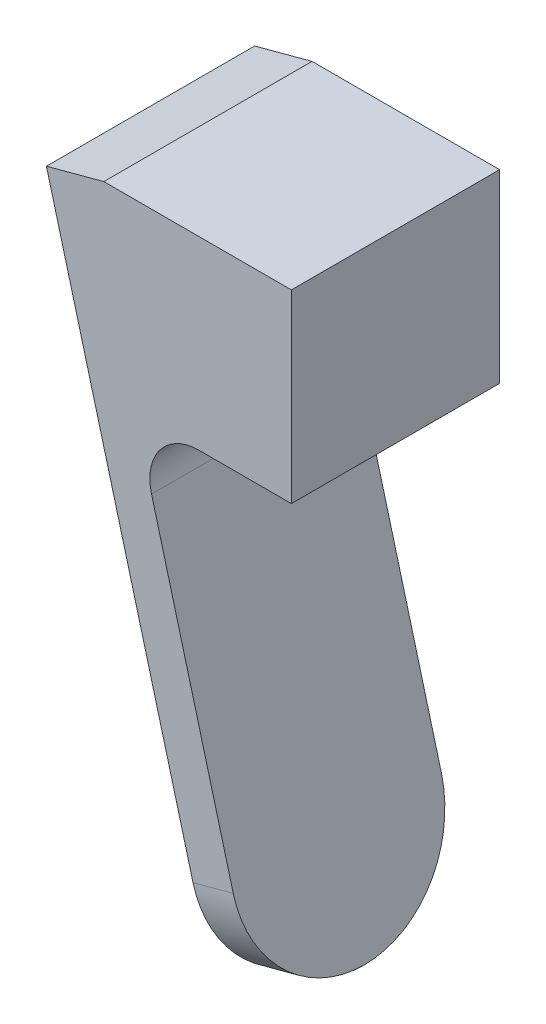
ISO-10303-21;
HEADER;
FILE_DESCRIPTION(('STEP AP214'),'2;1');
FILE_NAME('part.step','',(''),(''),'','','');
FILE_SCHEMA(('AUTOMOTIVE_DESIGN { 1 0 10303 214 1 1 1 1 }'));
ENDSEC;
DATA;
#1=APPLICATION_CONTEXT('core data for automotive mechanical design processes');
#2=APPLICATION_PROTOCOL_DEFINITION('international standard','automotive_design',2000,#1);
#3=PRODUCT_CONTEXT('',#1,'mechanical');
#4=PRODUCT('Part','Part','',(#3));
#5=PRODUCT_RELATED_PRODUCT_CATEGORY('part','',(#4));
#6=PRODUCT_DEFINITION_FORMATION('','',#4);
#7=PRODUCT_DEFINITION_CONTEXT('part definition',#1,'design');
#8=PRODUCT_DEFINITION('design','',#6,#7);
#9=PRODUCT_DEFINITION_SHAPE('','',#8);
#10=(LENGTH_UNIT() NAMED_UNIT(*) SI_UNIT(.MILLI.,.METRE.));
#11=(NAMED_UNIT(*) PLANE_ANGLE_UNIT() SI_UNIT($,.RADIAN.));
#12=(NAMED_UNIT(*) SI_UNIT($,.STERADIAN.) SOLID_ANGLE_UNIT());
#13=UNCERTAINTY_MEASURE_WITH_UNIT(LENGTH_MEASURE(1.E-05),#10,'distance_accuracy_value','');
#14=(GEOMETRIC_REPRESENTATION_CONTEXT(3) GLOBAL_UNCERTAINTY_ASSIGNED_CONTEXT((#13)) GLOBAL_UNIT_ASSIGNED_CONTEXT((#10,
#11,#12)) REPRESENTATION_CONTEXT('',''));
#15=CARTESIAN_POINT('',(0.,0.,0.));
#16=DIRECTION('',(0.,0.,1.));
#17=DIRECTION('',(1.,0.,0.));
#18=AXIS2_PLACEMENT_3D('',#15,#16,#17);
#19=CARTESIAN_POINT('',(-8.22542405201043,-3.67171888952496,5.3975));
#20=DIRECTION('',(0.258819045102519,-0.965925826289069,0.));
#21=DIRECTION('',(0.965925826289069,0.258819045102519,0.));
#22=AXIS2_PLACEMENT_3D('',#19,#20,#21);
#23=PLANE('',#22);
#24=DIRECTION('',(-0.965925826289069,-0.258819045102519,0.));
#25=VECTOR('',#24,1.);
#26=CARTESIAN_POINT('',(-8.22542405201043,-3.67171888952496,-5.3975));
#27=LINE('',#26,#25);
#28=CARTESIAN_POINT('',(-5.24987969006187,-2.87442418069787,-5.3975));
#29=VERTEX_POINT('',#28);
#30=CARTESIAN_POINT('',(-8.22542405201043,-3.67171888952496,-5.3975));
#31=VERTEX_POINT('',#30);
#32=EDGE_CURVE('E140',#29,#31,#27,.T.);
#33=ORIENTED_EDGE('',*,*,#32,.T.);
#34=DIRECTION('',(0.,0.,-1.));
#35=VECTOR('',#34,1.);
#36=CARTESIAN_POINT('',(-8.22542405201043,-3.67171888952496,5.3975));
#37=LINE('',#36,#35);
#38=CARTESIAN_POINT('',(-8.22542405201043,-3.67171888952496,5.3975));
#39=VERTEX_POINT('',#38);
#40=EDGE_CURVE('E165',#39,#31,#37,.T.);
#41=ORIENTED_EDGE('',*,*,#40,.F.);
#42=DIRECTION('',(-0.965925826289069,-0.258819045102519,0.));
#43=VECTOR('',#42,1.);
#44=CARTESIAN_POINT('',(-8.22542405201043,-3.67171888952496,5.3975));
#45=LINE('',#44,#43);
#46=CARTESIAN_POINT('',(-5.24987969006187,-2.87442418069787,5.3975));
#47=VERTEX_POINT('',#46);
#48=EDGE_CURVE('E132',#47,#39,#45,.T.);
#49=ORIENTED_EDGE('',*,*,#48,.F.);
#50=DIRECTION('',(0.,0.,-1.));
#51=VECTOR('',#50,1.);
#52=CARTESIAN_POINT('',(-5.24987969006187,-2.87442418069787,5.3975));
#53=LINE('',#52,#51);
#54=EDGE_CURVE('E139',#47,#29,#53,.T.);
#55=ORIENTED_EDGE('',*,*,#54,.T.);
#56=EDGE_LOOP('',(#33,#41,#49,#55));
#57=FACE_BOUND('',#56,.T.);
#58=ADVANCED_FACE('F33',(#57),#23,.F.);
#59=CARTESIAN_POINT('',(-8.22542405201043,-3.67171888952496,5.3975));
#60=DIRECTION('',(0.965925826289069,0.258819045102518,0.));
#61=DIRECTION('',(-0.258819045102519,0.965925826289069,0.));
#62=AXIS2_PLACEMENT_3D('',#59,#60,#61);
#63=PLANE('',#62);
#64=DIRECTION('',(0.258819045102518,-0.965925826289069,0.));
#65=VECTOR('',#64,1.);
#66=CARTESIAN_POINT('',(-8.22542405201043,-3.67171888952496,-5.3975));
#67=LINE('',#66,#65);
#68=CARTESIAN_POINT('',(-0.624990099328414,-32.0369245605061,-5.3975));
#69=VERTEX_POINT('',#68);
#70=EDGE_CURVE('E143',#31,#69,#67,.T.);
#71=ORIENTED_EDGE('',*,*,#70,.T.);
#72=CARTESIAN_POINT('',(-0.624990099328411,-32.0369245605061,0.));
#73=DIRECTION('',(0.965925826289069,0.258819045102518,0.));
#74=DIRECTION('',(-0.258819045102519,0.965925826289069,0.));
#75=AXIS2_PLACEMENT_3D('',#72,#73,#74);
#76=CIRCLE('',#75,5.3975);
#77=CARTESIAN_POINT('',(0.622258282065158,-36.6917188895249,-2.43110416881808));
#78=VERTEX_POINT('',#77);
#79=EDGE_CURVE('E48',#69,#78,#76,.F.);
#80=ORIENTED_EDGE('',*,*,#79,.T.);
#81=DIRECTION('',(0.,0.,-1.));
#82=VECTOR('',#81,1.);
#83=CARTESIAN_POINT('',(0.622258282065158,-36.6917188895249,5.3975));
#84=LINE('',#83,#82);
#85=CARTESIAN_POINT('',(0.622258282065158,-36.6917188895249,2.43110416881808));
#86=VERTEX_POINT('',#85);
#87=EDGE_CURVE('E162',#86,#78,#84,.T.);
#88=ORIENTED_EDGE('',*,*,#87,.F.);
#89=CARTESIAN_POINT('',(-0.624990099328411,-32.0369245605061,5.3975));
#90=VERTEX_POINT('',#89);
#91=EDGE_CURVE('E199',#86,#90,#76,.F.);
#92=ORIENTED_EDGE('',*,*,#91,.T.);
#93=DIRECTION('',(0.258819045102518,-0.965925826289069,0.));
#94=VECTOR('',#93,1.);
#95=CARTESIAN_POINT('',(-8.22542405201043,-3.67171888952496,5.3975));
#96=LINE('',#95,#94);
#97=EDGE_CURVE('E121',#39,#90,#96,.T.);
#98=ORIENTED_EDGE('',*,*,#97,.F.);
#99=ORIENTED_EDGE('',*,*,#40,.T.);
#100=EDGE_LOOP('',(#71,#80,#88,#92,#98,#99));
#101=FACE_BOUND('',#100,.T.);
#102=ADVANCED_FACE('F203',(#101),#63,.F.);
#103=CARTESIAN_POINT('',(0.622258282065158,-36.6917188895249,5.3975));
#104=DIRECTION('',(0.,1.,0.));
#105=DIRECTION('',(-1.,0.,0.));
#106=AXIS2_PLACEMENT_3D('',#103,#104,#105);
#107=PLANE('',#106);
#108=CARTESIAN_POINT('',(-17.9969190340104,-36.6917188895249,0.));
#109=DIRECTION('',(0.,1.,0.));
#110=DIRECTION('',(1.,0.,0.));
#111=AXIS2_PLACEMENT_3D('',#108,#109,#110);
#112=ELLIPSE('',#111,20.854338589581,5.3975);
#113=CARTESIAN_POINT('',(2.85741955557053,-36.691718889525,0.));
#114=VERTEX_POINT('',#113);
#115=EDGE_CURVE('E122',#78,#114,#112,.F.);
#116=ORIENTED_EDGE('',*,*,#115,.T.);
#117=EDGE_CURVE('E111',#114,#86,#112,.F.);
#118=ORIENTED_EDGE('',*,*,#117,.T.);
#119=ORIENTED_EDGE('',*,*,#87,.T.);
#120=EDGE_LOOP('',(#116,#118,#119));
#121=FACE_BOUND('',#120,.T.);
#122=ADVANCED_FACE('F206',(#121),#107,.F.);
#123=CARTESIAN_POINT('',(2.85741955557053,-36.691718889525,5.3975));
#124=DIRECTION('',(-0.965925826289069,-0.258819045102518,0.));
#125=DIRECTION('',(0.258819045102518,-0.965925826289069,0.));
#126=AXIS2_PLACEMENT_3D('',#123,#124,#125);
#127=PLANE('',#126);
#128=CARTESIAN_POINT('',(1.46044375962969,-31.4781342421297,0.));
#129=DIRECTION('',(-0.965925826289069,-0.258819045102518,0.));
#130=DIRECTION('',(-0.258819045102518,0.965925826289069,0.));
#131=AXIS2_PLACEMENT_3D('',#128,#129,#130);
#132=CIRCLE('',#131,5.3975);
#133=CARTESIAN_POINT('',(1.46044375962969,-31.4781342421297,5.3975));
#134=VERTEX_POINT('',#133);
#135=EDGE_CURVE('E106',#114,#134,#132,.T.);
#136=ORIENTED_EDGE('',*,*,#135,.F.);
#137=CARTESIAN_POINT('',(1.46044375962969,-31.4781342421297,-5.3975));
#138=VERTEX_POINT('',#137);
#139=EDGE_CURVE('E116',#138,#114,#132,.T.);
#140=ORIENTED_EDGE('',*,*,#139,.F.);
#141=DIRECTION('',(-0.258819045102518,0.965925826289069,0.));
#142=VECTOR('',#141,1.);
#143=CARTESIAN_POINT('',(2.85741955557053,-36.691718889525,-5.3975));
#144=LINE('',#143,#142);
#145=CARTESIAN_POINT('',(-2.77601330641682,-15.6674612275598,-5.3975));
#146=VERTEX_POINT('',#145);
#147=EDGE_CURVE('E146',#138,#146,#144,.T.);
#148=ORIENTED_EDGE('',*,*,#147,.T.);
#149=DIRECTION('',(0.,0.,-1.));
#150=VECTOR('',#149,1.);
#151=CARTESIAN_POINT('',(-2.77601330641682,-15.6674612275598,5.3975));
#152=LINE('',#151,#150);
#153=CARTESIAN_POINT('',(-2.77601330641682,-15.6674612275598,5.3975));
#154=VERTEX_POINT('',#153);
#155=EDGE_CURVE('E126',#146,#154,#152,.F.);
#156=ORIENTED_EDGE('',*,*,#155,.T.);
#157=DIRECTION('',(-0.258819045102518,0.965925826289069,0.));
#158=VECTOR('',#157,1.);
#159=CARTESIAN_POINT('',(2.85741955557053,-36.691718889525,5.3975));
#160=LINE('',#159,#158);
#161=EDGE_CURVE('E55',#134,#154,#160,.T.);
#162=ORIENTED_EDGE('',*,*,#161,.F.);
#163=EDGE_LOOP('',(#136,#140,#148,#156,#162));
#164=FACE_BOUND('',#163,.T.);
#165=ADVANCED_FACE('F124',(#164),#127,.F.);
#166=CARTESIAN_POINT('',(4.47457594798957,-12.4700608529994,5.3975));
#167=DIRECTION('',(0.,1.,0.));
#168=DIRECTION('',(-1.,0.,0.));
#169=AXIS2_PLACEMENT_3D('',#166,#167,#168);
#170=PLANE('',#169);
#171=DIRECTION('',(1.,0.,0.));
#172=VECTOR('',#171,1.);
#173=CARTESIAN_POINT('',(4.47457594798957,-12.4700608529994,5.3975));
#174=LINE('',#173,#172);
#175=CARTESIAN_POINT('',(-0.322561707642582,-12.4700608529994,5.3975));
#176=VERTEX_POINT('',#175);
#177=CARTESIAN_POINT('',(4.47457594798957,-12.4700608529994,5.3975));
#178=VERTEX_POINT('',#177);
#179=EDGE_CURVE('E128',#176,#178,#174,.T.);
#180=ORIENTED_EDGE('',*,*,#179,.F.);
#181=DIRECTION('',(0.,0.,-1.));
#182=VECTOR('',#181,1.);
#183=CARTESIAN_POINT('',(-0.322561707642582,-12.4700608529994,-5.3975));
#184=LINE('',#183,#182);
#185=CARTESIAN_POINT('',(-0.322561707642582,-12.4700608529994,-5.3975));
#186=VERTEX_POINT('',#185);
#187=EDGE_CURVE('E168',#176,#186,#184,.T.);
#188=ORIENTED_EDGE('',*,*,#187,.T.);
#189=DIRECTION('',(1.,0.,0.));
#190=VECTOR('',#189,1.);
#191=CARTESIAN_POINT('',(4.47457594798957,-12.4700608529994,-5.3975));
#192=LINE('',#191,#190);
#193=CARTESIAN_POINT('',(4.47457594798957,-12.4700608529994,-5.3975));
#194=VERTEX_POINT('',#193);
#195=EDGE_CURVE('E148',#186,#194,#192,.T.);
#196=ORIENTED_EDGE('',*,*,#195,.T.);
#197=DIRECTION('',(0.,0.,-1.));
#198=VECTOR('',#197,1.);
#199=CARTESIAN_POINT('',(4.47457594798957,-12.4700608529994,5.3975));
#200=LINE('',#199,#198);
#201=EDGE_CURVE('E159',#178,#194,#200,.T.);
#202=ORIENTED_EDGE('',*,*,#201,.F.);
#203=EDGE_LOOP('',(#180,#188,#196,#202));
#204=FACE_BOUND('',#203,.T.);
#205=ADVANCED_FACE('F179',(#204),#170,.F.);
#206=CARTESIAN_POINT('',(4.47457594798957,-2.87442418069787,5.3975));
#207=DIRECTION('',(-1.,0.,0.));
#208=DIRECTION('',(0.,-1.,0.));
#209=AXIS2_PLACEMENT_3D('',#206,#207,#208);
#210=PLANE('',#209);
#211=DIRECTION('',(0.,1.,0.));
#212=VECTOR('',#211,1.);
#213=CARTESIAN_POINT('',(4.47457594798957,-2.87442418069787,-5.3975));
#214=LINE('',#213,#212);
#215=CARTESIAN_POINT('',(4.47457594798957,-2.87442418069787,-5.3975));
#216=VERTEX_POINT('',#215);
#217=EDGE_CURVE('E150',#194,#216,#214,.T.);
#218=ORIENTED_EDGE('',*,*,#217,.T.);
#219=DIRECTION('',(0.,0.,-1.));
#220=VECTOR('',#219,1.);
#221=CARTESIAN_POINT('',(4.47457594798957,-2.87442418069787,5.3975));
#222=LINE('',#221,#220);
#223=CARTESIAN_POINT('',(4.47457594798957,-2.87442418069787,5.3975));
#224=VERTEX_POINT('',#223);
#225=EDGE_CURVE('E156',#224,#216,#222,.T.);
#226=ORIENTED_EDGE('',*,*,#225,.F.);
#227=DIRECTION('',(0.,1.,0.));
#228=VECTOR('',#227,1.);
#229=CARTESIAN_POINT('',(4.47457594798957,-2.87442418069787,5.3975));
#230=LINE('',#229,#228);
#231=EDGE_CURVE('E130',#178,#224,#230,.T.);
#232=ORIENTED_EDGE('',*,*,#231,.F.);
#233=ORIENTED_EDGE('',*,*,#201,.T.);
#234=EDGE_LOOP('',(#218,#226,#232,#233));
#235=FACE_BOUND('',#234,.T.);
#236=ADVANCED_FACE('F188',(#235),#210,.F.);
#237=CARTESIAN_POINT('',(-5.24987969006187,-2.87442418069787,5.3975));
#238=DIRECTION('',(0.,-1.,0.));
#239=DIRECTION('',(1.,0.,0.));
#240=AXIS2_PLACEMENT_3D('',#237,#238,#239);
#241=PLANE('',#240);
#242=DIRECTION('',(-1.,0.,0.));
#243=VECTOR('',#242,1.);
#244=CARTESIAN_POINT('',(-5.24987969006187,-2.87442418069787,-5.3975));
#245=LINE('',#244,#243);
#246=EDGE_CURVE('E152',#216,#29,#245,.T.);
#247=ORIENTED_EDGE('',*,*,#246,.T.);
#248=ORIENTED_EDGE('',*,*,#54,.F.);
#249=DIRECTION('',(-1.,0.,0.));
#250=VECTOR('',#249,1.);
#251=CARTESIAN_POINT('',(-5.24987969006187,-2.87442418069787,5.3975));
#252=LINE('',#251,#250);
#253=EDGE_CURVE('E137',#224,#47,#252,.T.);
#254=ORIENTED_EDGE('',*,*,#253,.F.);
#255=ORIENTED_EDGE('',*,*,#225,.T.);
#256=EDGE_LOOP('',(#247,#248,#254,#255));
#257=FACE_BOUND('',#256,.T.);
#258=ADVANCED_FACE('F195',(#257),#241,.F.);
#259=CARTESIAN_POINT('',(0.,0.,5.3975));
#260=DIRECTION('',(0.,0.,1.));
#261=DIRECTION('',(1.,0.,0.));
#262=AXIS2_PLACEMENT_3D('',#259,#260,#261);
#263=PLANE('',#262);
#264=DIRECTION('',(0.965925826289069,0.258819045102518,0.));
#265=VECTOR('',#264,1.);
#266=CARTESIAN_POINT('',(-8.96672553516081,-34.2720858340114,5.3975));
#267=LINE('',#266,#265);
#268=EDGE_CURVE('E108',#90,#134,#267,.T.);
#269=ORIENTED_EDGE('',*,*,#268,.T.);
#270=ORIENTED_EDGE('',*,*,#161,.T.);
#271=CARTESIAN_POINT('',(-0.322561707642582,-15.0100608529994,5.3975));
#272=DIRECTION('',(0.,0.,1.));
#273=DIRECTION('',(1.,0.,0.));
#274=AXIS2_PLACEMENT_3D('',#271,#272,#273);
#275=CIRCLE('',#274,2.54);
#276=EDGE_CURVE('E41',#154,#176,#275,.F.);
#277=ORIENTED_EDGE('',*,*,#276,.T.);
#278=ORIENTED_EDGE('',*,*,#179,.T.);
#279=ORIENTED_EDGE('',*,*,#231,.T.);
#280=ORIENTED_EDGE('',*,*,#253,.T.);
#281=ORIENTED_EDGE('',*,*,#48,.T.);
#282=ORIENTED_EDGE('',*,*,#97,.T.);
#283=EDGE_LOOP('',(#269,#270,#277,#278,#279,#280,#281,#282));
#284=FACE_BOUND('',#283,.T.);
#285=ADVANCED_FACE('F119',(#284),#263,.T.);
#286=CARTESIAN_POINT('',(0.,0.,-5.3975));
#287=DIRECTION('',(0.,0.,1.));
#288=DIRECTION('',(1.,0.,0.));
#289=AXIS2_PLACEMENT_3D('',#286,#287,#288);
#290=PLANE('',#289);
#291=ORIENTED_EDGE('',*,*,#147,.F.);
#292=DIRECTION('',(-0.965925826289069,-0.258819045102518,0.));
#293=VECTOR('',#292,1.);
#294=CARTESIAN_POINT('',(7.96736474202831,-29.7346100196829,-5.3975));
#295=LINE('',#294,#293);
#296=EDGE_CURVE('E11',#138,#69,#295,.T.);
#297=ORIENTED_EDGE('',*,*,#296,.T.);
#298=ORIENTED_EDGE('',*,*,#70,.F.);
#299=ORIENTED_EDGE('',*,*,#32,.F.);
#300=ORIENTED_EDGE('',*,*,#246,.F.);
#301=ORIENTED_EDGE('',*,*,#217,.F.);
#302=ORIENTED_EDGE('',*,*,#195,.F.);
#303=CARTESIAN_POINT('',(-0.322561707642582,-15.0100608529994,-5.3975));
#304=DIRECTION('',(0.,0.,1.));
#305=DIRECTION('',(1.,0.,0.));
#306=AXIS2_PLACEMENT_3D('',#303,#304,#305);
#307=CIRCLE('',#306,2.54);
#308=EDGE_CURVE('E172',#186,#146,#307,.T.);
#309=ORIENTED_EDGE('',*,*,#308,.T.);
#310=EDGE_LOOP('',(#291,#297,#298,#299,#300,#301,#302,#309));
#311=FACE_BOUND('',#310,.T.);
#312=ADVANCED_FACE('F184',(#311),#290,.F.);
#313=CARTESIAN_POINT('',(-0.322561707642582,-15.0100608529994,5.3975));
#314=DIRECTION('',(0.,0.,1.));
#315=DIRECTION('',(1.,0.,0.));
#316=AXIS2_PLACEMENT_3D('',#313,#314,#315);
#317=CYLINDRICAL_SURFACE('',#316,2.54);
#318=ORIENTED_EDGE('',*,*,#276,.F.);
#319=ORIENTED_EDGE('',*,*,#155,.F.);
#320=ORIENTED_EDGE('',*,*,#308,.F.);
#321=ORIENTED_EDGE('',*,*,#187,.F.);
#322=EDGE_LOOP('',(#318,#319,#320,#321));
#323=FACE_BOUND('',#322,.T.);
#324=ADVANCED_FACE('F35',(#323),#317,.F.);
#325=CARTESIAN_POINT('',(-8.96672553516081,-34.2720858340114,0.));
#326=DIRECTION('',(0.965925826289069,0.258819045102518,0.));
#327=DIRECTION('',(-0.258819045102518,0.965925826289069,0.));
#328=AXIS2_PLACEMENT_3D('',#325,#326,#327);
#329=CYLINDRICAL_SURFACE('',#328,5.3975);
#330=ORIENTED_EDGE('',*,*,#296,.F.);
#331=ORIENTED_EDGE('',*,*,#139,.T.);
#332=ORIENTED_EDGE('',*,*,#115,.F.);
#333=ORIENTED_EDGE('',*,*,#79,.F.);
#334=EDGE_LOOP('',(#330,#331,#332,#333));
#335=FACE_BOUND('',#334,.T.);
#336=ADVANCED_FACE('F201',(#335),#329,.T.);
#337=ORIENTED_EDGE('',*,*,#117,.F.);
#338=ORIENTED_EDGE('',*,*,#135,.T.);
#339=ORIENTED_EDGE('',*,*,#268,.F.);
#340=ORIENTED_EDGE('',*,*,#91,.F.);
#341=EDGE_LOOP('',(#337,#338,#339,#340));
#342=FACE_BOUND('',#341,.T.);
#343=ADVANCED_FACE('F107',(#342),#329,.T.);
#344=CLOSED_SHELL('',(#58,#102,#122,#165,#205,#236,#258,#285,#312,#324,#336,#343));
#345=MANIFOLD_SOLID_BREP('B2',#344);
#346=ADVANCED_BREP_SHAPE_REPRESENTATION('',(#18,#345),#14);
#347=SHAPE_DEFINITION_REPRESENTATION(#9,#346);
ENDSEC;
END-ISO-10303-21;
